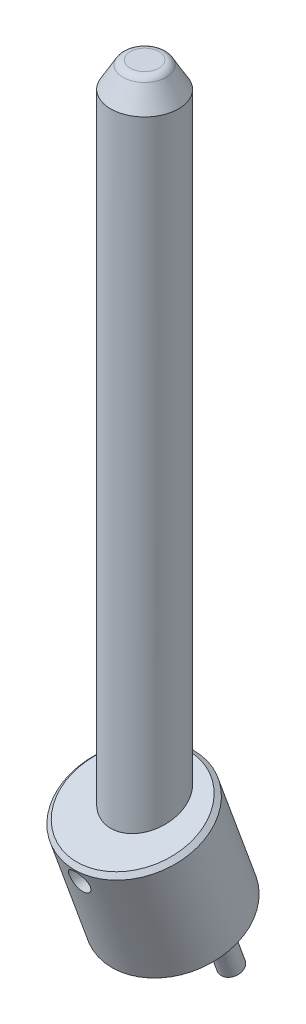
ISO-10303-21;
HEADER;
FILE_DESCRIPTION(('STEP AP214'),'2;1');
FILE_NAME('part.step','',(''),(''),'','','');
FILE_SCHEMA(('AUTOMOTIVE_DESIGN { 1 0 10303 214 1 1 1 1 }'));
ENDSEC;
DATA;
#1=APPLICATION_CONTEXT('core data for automotive mechanical design processes');
#2=APPLICATION_PROTOCOL_DEFINITION('international standard','automotive_design',2000,#1);
#3=PRODUCT_CONTEXT('',#1,'mechanical');
#4=PRODUCT('Part','Part','',(#3));
#5=PRODUCT_RELATED_PRODUCT_CATEGORY('part','',(#4));
#6=PRODUCT_DEFINITION_FORMATION('','',#4);
#7=PRODUCT_DEFINITION_CONTEXT('part definition',#1,'design');
#8=PRODUCT_DEFINITION('design','',#6,#7);
#9=PRODUCT_DEFINITION_SHAPE('','',#8);
#10=(LENGTH_UNIT() NAMED_UNIT(*) SI_UNIT(.MILLI.,.METRE.));
#11=(NAMED_UNIT(*) PLANE_ANGLE_UNIT() SI_UNIT($,.RADIAN.));
#12=(NAMED_UNIT(*) SI_UNIT($,.STERADIAN.) SOLID_ANGLE_UNIT());
#13=UNCERTAINTY_MEASURE_WITH_UNIT(LENGTH_MEASURE(1.E-05),#10,'distance_accuracy_value','');
#14=(GEOMETRIC_REPRESENTATION_CONTEXT(3) GLOBAL_UNCERTAINTY_ASSIGNED_CONTEXT((#13)) GLOBAL_UNIT_ASSIGNED_CONTEXT((#10,
#11,#12)) REPRESENTATION_CONTEXT('',''));
#15=CARTESIAN_POINT('',(0.,0.,0.));
#16=DIRECTION('',(0.,0.,1.));
#17=DIRECTION('',(1.,0.,0.));
#18=AXIS2_PLACEMENT_3D('',#15,#16,#17);
#19=CARTESIAN_POINT('',(0.,174.,0.));
#20=DIRECTION('',(0.,1.,0.));
#21=DIRECTION('',(-1.,0.,0.));
#22=AXIS2_PLACEMENT_3D('',#19,#20,#21);
#23=PLANE('',#22);
#24=CARTESIAN_POINT('',(0.,174.,-3.381197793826));
#25=CARTESIAN_POINT('',(0.0491775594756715,174.,-3.38119852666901));
#26=CARTESIAN_POINT('',(0.0983550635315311,174.,-3.38012493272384));
#27=CARTESIAN_POINT('',(0.196616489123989,174.,-3.37583435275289));
#28=CARTESIAN_POINT('',(0.245700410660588,174.,-3.37261736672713));
#29=CARTESIAN_POINT('',(0.343681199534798,174.,-3.3640452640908));
#30=CARTESIAN_POINT('',(0.392578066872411,174.,-3.35869014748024));
#31=CARTESIAN_POINT('',(0.490091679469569,174.,-3.34585220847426));
#32=CARTESIAN_POINT('',(0.538708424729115,174.,-3.33836938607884));
#33=CARTESIAN_POINT('',(0.635569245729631,174.,-3.32129021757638));
#34=CARTESIAN_POINT('',(0.683813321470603,174.,-3.31169387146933));
#35=CARTESIAN_POINT('',(0.779836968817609,174.,-3.29040593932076));
#36=CARTESIAN_POINT('',(0.827616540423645,174.,-3.27871435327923));
#37=CARTESIAN_POINT('',(0.922620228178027,174.,-3.25325819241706));
#38=CARTESIAN_POINT('',(0.969844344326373,174.,-3.23949361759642));
#39=CARTESIAN_POINT('',(1.06364722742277,174.,-3.20991768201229));
#40=CARTESIAN_POINT('',(1.11022599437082,174.,-3.19410632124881));
#41=CARTESIAN_POINT('',(1.20264951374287,174.,-3.16046691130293));
#42=CARTESIAN_POINT('',(1.24849426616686,174.,-3.14263886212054));
#43=CARTESIAN_POINT('',(1.33936248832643,174.,-3.10500001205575));
#44=CARTESIAN_POINT('',(1.384385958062,174.,-3.08518921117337));
#45=CARTESIAN_POINT('',(1.47352591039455,174.,-3.04362256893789));
#46=CARTESIAN_POINT('',(1.51764239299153,174.,-3.02186672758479));
#47=CARTESIAN_POINT('',(1.60488439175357,174.,-2.9764514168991));
#48=CARTESIAN_POINT('',(1.64800990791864,174.,-2.9527919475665));
#49=CARTESIAN_POINT('',(1.73318788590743,174.,-2.90361442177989));
#50=CARTESIAN_POINT('',(1.77524034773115,174.,-2.87809636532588));
#51=CARTESIAN_POINT('',(1.85819215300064,174.,-2.82525022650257));
#52=CARTESIAN_POINT('',(1.89909149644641,174.,-2.79792214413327));
#53=CARTESIAN_POINT('',(1.97965926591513,174.,-2.74150802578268));
#54=CARTESIAN_POINT('',(2.01932769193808,174.000000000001,-2.7124219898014));
#55=CARTESIAN_POINT('',(2.09735790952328,174.,-2.65254713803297));
#56=CARTESIAN_POINT('',(2.13571970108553,173.999999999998,-2.62175832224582));
#57=CARTESIAN_POINT('',(2.21106439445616,174.000000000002,-2.55853723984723));
#58=CARTESIAN_POINT('',(2.24804729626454,174.000000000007,-2.52610497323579));
#59=CARTESIAN_POINT('',(2.32056094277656,173.999999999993,-2.45965603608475));
#60=CARTESIAN_POINT('',(2.3560916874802,173.999999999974,-2.42563936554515));
#61=CARTESIAN_POINT('',(2.42705213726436,174.000000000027,-2.35468855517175));
#62=CARTESIAN_POINT('',(2.46241950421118,174.000000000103,-2.31769205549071));
#63=CARTESIAN_POINT('',(2.5314601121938,173.999999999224,-2.24214947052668));
#64=CARTESIAN_POINT('',(2.56513331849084,173.999999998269,-2.20360335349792));
#65=CARTESIAN_POINT('',(2.63071590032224,173.99999999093,-2.12503640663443));
#66=CARTESIAN_POINT('',(2.66262520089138,173.999999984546,-2.08501551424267));
#67=CARTESIAN_POINT('',(2.72461562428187,173.999999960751,-2.00357584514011));
#68=CARTESIAN_POINT('',(2.75469662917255,173.999999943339,-1.96215697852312));
#69=CARTESIAN_POINT('',(2.7984051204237,173.999999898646,-1.89905244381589));
#70=CARTESIAN_POINT('',(2.81273996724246,173.999999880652,-1.87785353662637));
#71=CARTESIAN_POINT('',(2.84090934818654,173.999999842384,-1.83514783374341));
#72=CARTESIAN_POINT('',(2.85474423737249,173.999999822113,-1.81364127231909));
#73=CARTESIAN_POINT('',(2.89548728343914,173.999999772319,-1.74864245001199));
#74=CARTESIAN_POINT('',(2.92163476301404,173.999999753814,-1.70466969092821));
#75=CARTESIAN_POINT('',(2.97183520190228,173.999999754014,-1.61554840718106));
#76=CARTESIAN_POINT('',(2.99588817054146,173.99999977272,-1.57039988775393));
#77=CARTESIAN_POINT('',(3.04188859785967,173.999999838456,-1.47904330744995));
#78=CARTESIAN_POINT('',(3.06383619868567,173.999999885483,-1.4328353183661));
#79=CARTESIAN_POINT('',(3.10541271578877,173.999999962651,-1.33939702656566));
#80=CARTESIAN_POINT('',(3.1250419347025,173.999999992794,-1.29216685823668));
#81=CARTESIAN_POINT('',(3.15291976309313,174.000000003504,-1.22146858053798));
#82=CARTESIAN_POINT('',(3.16183489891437,174.000000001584,-1.19825675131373));
#83=CARTESIAN_POINT('',(3.19901992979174,173.999999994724,-1.09818755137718));
#84=CARTESIAN_POINT('',(3.22479363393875,173.99999999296,-1.02037068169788));
#85=CARTESIAN_POINT('',(3.25883872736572,173.999999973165,-0.903503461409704));
#86=CARTESIAN_POINT('',(3.26930037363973,173.999999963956,-0.865070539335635));
#87=CARTESIAN_POINT('',(3.29035807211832,173.999999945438,-0.78187482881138));
#88=CARTESIAN_POINT('',(3.30072437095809,173.999999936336,-0.737052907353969));
#89=CARTESIAN_POINT('',(3.31424558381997,173.999999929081,-0.672514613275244));
#90=CARTESIAN_POINT('',(3.31816009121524,173.999999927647,-0.652953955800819));
#91=CARTESIAN_POINT('',(3.32632060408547,173.999999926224,-0.610180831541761));
#92=CARTESIAN_POINT('',(3.33049625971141,173.999999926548,-0.586954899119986));
#93=CARTESIAN_POINT('',(3.34228609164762,173.999999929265,-0.517153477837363));
#94=CARTESIAN_POINT('',(3.34916374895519,173.999999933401,-0.470451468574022));
#95=CARTESIAN_POINT('',(3.36093725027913,173.999999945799,-0.376800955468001));
#96=CARTESIAN_POINT('',(3.36583314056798,173.999999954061,-0.329852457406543));
#97=CARTESIAN_POINT('',(3.37363894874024,173.999999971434,-0.235792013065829));
#98=CARTESIAN_POINT('',(3.37654894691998,173.999999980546,-0.188680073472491));
#99=CARTESIAN_POINT('',(3.38036477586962,173.999999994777,-0.094378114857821));
#100=CARTESIAN_POINT('',(3.38127072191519,173.999999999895,-0.047188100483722));
#101=CARTESIAN_POINT('',(3.38112480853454,174.000000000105,0.0472251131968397));
#102=CARTESIAN_POINT('',(3.38007141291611,173.999999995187,0.0944483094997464));
#103=CARTESIAN_POINT('',(3.3760506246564,173.999999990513,0.188811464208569));
#104=CARTESIAN_POINT('',(3.3730832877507,173.999999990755,0.235951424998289));
#105=CARTESIAN_POINT('',(3.36523468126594,173.99999999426,0.330073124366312));
#106=CARTESIAN_POINT('',(3.3603533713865,173.999999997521,0.377054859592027));
#107=CARTESIAN_POINT('',(3.34865879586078,174.000000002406,0.470780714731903));
#108=CARTESIAN_POINT('',(3.34184539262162,174.000000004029,0.517524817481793));
#109=CARTESIAN_POINT('',(3.33026552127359,173.999999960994,0.587415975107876));
#110=CARTESIAN_POINT('',(3.32617861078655,173.999999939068,0.610677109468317));
#111=CARTESIAN_POINT('',(3.32001382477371,173.999999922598,0.643328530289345));
#112=CARTESIAN_POINT('',(3.31818160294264,173.999999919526,0.652765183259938));
#113=CARTESIAN_POINT('',(3.30790809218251,173.999999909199,0.704387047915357));
#114=CARTESIAN_POINT('',(3.29862776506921,173.999999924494,0.746407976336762));
#115=CARTESIAN_POINT('',(3.27611885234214,173.999999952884,0.839847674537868));
#116=CARTESIAN_POINT('',(3.26247449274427,173.999999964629,0.891165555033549));
#117=CARTESIAN_POINT('',(3.22698341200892,173.999999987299,1.01297067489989));
#118=CARTESIAN_POINT('',(3.20401223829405,173.999999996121,1.08313569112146));
#119=CARTESIAN_POINT('',(3.16757439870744,174.00000000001,1.18334600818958));
#120=CARTESIAN_POINT('',(3.15590282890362,173.999999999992,1.21405838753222));
#121=CARTESIAN_POINT('',(3.12494638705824,174.000000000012,1.29216796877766));
#122=CARTESIAN_POINT('',(3.10504412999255,174.000000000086,1.33932319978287));
#123=CARTESIAN_POINT('',(3.06313614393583,173.999999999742,1.4326885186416));
#124=CARTESIAN_POINT('',(3.04113038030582,173.999999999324,1.47889859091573));
#125=CARTESIAN_POINT('',(2.99507134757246,173.999999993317,1.5702891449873));
#126=CARTESIAN_POINT('',(2.97101799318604,173.999999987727,1.61546958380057));
#127=CARTESIAN_POINT('',(2.92090425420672,173.99999996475,1.7047092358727));
#128=CARTESIAN_POINT('',(2.8948437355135,173.999999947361,1.74876837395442));
#129=CARTESIAN_POINT('',(2.85429856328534,173.9999999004,1.81395013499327));
#130=CARTESIAN_POINT('',(2.84054017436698,173.999999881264,1.83552759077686));
#131=CARTESIAN_POINT('',(2.81254197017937,173.999999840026,1.87834577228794));
#132=CARTESIAN_POINT('',(2.79830250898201,173.999999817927,1.89958672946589));
#133=CARTESIAN_POINT('',(2.75484041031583,173.999999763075,1.96280026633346));
#134=CARTESIAN_POINT('',(2.72487327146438,173.999999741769,2.00426477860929));
#135=CARTESIAN_POINT('',(2.66302492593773,173.999999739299,2.08573639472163));
#136=CARTESIAN_POINT('',(2.63114372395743,173.999999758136,2.12574350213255));
#137=CARTESIAN_POINT('',(2.56557045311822,173.999999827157,2.2042443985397));
#138=CARTESIAN_POINT('',(2.53187850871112,173.99999987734,2.2427382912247));
#139=CARTESIAN_POINT('',(2.46263073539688,173.999999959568,2.3179988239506));
#140=CARTESIAN_POINT('',(2.42707515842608,173.999999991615,2.35476569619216));
#141=CARTESIAN_POINT('',(2.37140677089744,174.000000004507,2.41027252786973));
#142=CARTESIAN_POINT('',(2.35175738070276,174.000000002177,2.42948514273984));
#143=CARTESIAN_POINT('',(2.26802085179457,173.999999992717,2.50941121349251));
#144=CARTESIAN_POINT('',(2.2017787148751,173.999999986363,2.56792039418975));
#145=CARTESIAN_POINT('',(2.10003782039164,173.999999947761,2.65091291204));
#146=CARTESIAN_POINT('',(2.06619123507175,173.999999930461,2.67746023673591));
#147=CARTESIAN_POINT('',(1.99205588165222,173.999999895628,2.73332764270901));
#148=CARTESIAN_POINT('',(1.95159524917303,173.999999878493,2.76242170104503));
#149=CARTESIAN_POINT('',(1.89261855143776,173.99999986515,2.80284358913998));
#150=CARTESIAN_POINT('',(1.87461412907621,173.999999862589,2.81492542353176));
#151=CARTESIAN_POINT('',(1.83512217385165,173.99999986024,2.84086885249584));
#152=CARTESIAN_POINT('',(1.81358900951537,173.999999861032,2.85466108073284));
#153=CARTESIAN_POINT('',(1.74852510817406,173.999999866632,2.89529179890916));
#154=CARTESIAN_POINT('',(1.70452676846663,173.999999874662,2.92138652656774));
#155=CARTESIAN_POINT('',(1.6153818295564,173.999999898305,2.97152713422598));
#156=CARTESIAN_POINT('',(1.57023526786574,173.999999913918,2.99557308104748));
#157=CARTESIAN_POINT('',(1.47889045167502,173.999999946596,3.04157160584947));
#158=CARTESIAN_POINT('',(1.43269225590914,173.99999996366,3.06352430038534));
#159=CARTESIAN_POINT('',(1.33933610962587,173.99999999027,3.10527343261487));
#160=CARTESIAN_POINT('',(1.29217823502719,173.999999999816,3.12507004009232));
#161=CARTESIAN_POINT('',(1.20065831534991,174.00000000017,3.16109558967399));
#162=CARTESIAN_POINT('',(1.15635789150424,173.999999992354,3.17748154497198));
#163=CARTESIAN_POINT('',(1.06713504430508,173.999999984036,3.20845589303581));
#164=CARTESIAN_POINT('',(1.02221264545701,173.999999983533,3.22304435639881));
#165=CARTESIAN_POINT('',(0.931813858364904,173.999999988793,3.25039463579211));
#166=CARTESIAN_POINT('',(0.886337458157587,173.999999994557,3.26315641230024));
#167=CARTESIAN_POINT('',(0.794895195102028,174.000000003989,3.2868049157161));
#168=CARTESIAN_POINT('',(0.74892929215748,174.000000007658,3.29769148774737));
#169=CARTESIAN_POINT('',(0.686121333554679,173.999999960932,3.31129818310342));
#170=CARTESIAN_POINT('',(0.669443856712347,173.999999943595,3.31479031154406));
#171=CARTESIAN_POINT('',(0.639370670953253,173.999999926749,3.32077891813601));
#172=CARTESIAN_POINT('',(0.625986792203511,173.999999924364,3.32333471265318));
#173=CARTESIAN_POINT('',(0.5647818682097,173.999999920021,3.33461824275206));
#174=CARTESIAN_POINT('',(0.516772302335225,173.999999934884,3.34234416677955));
#175=CARTESIAN_POINT('',(0.428809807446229,173.999999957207,3.3545583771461));
#176=CARTESIAN_POINT('',(0.388901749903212,173.999999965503,3.35937566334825));
#177=CARTESIAN_POINT('',(0.315880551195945,173.99999997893,3.36686744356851));
#178=CARTESIAN_POINT('',(0.282790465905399,173.999999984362,3.36976874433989));
#179=CARTESIAN_POINT('',(0.198641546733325,173.999999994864,3.3759012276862));
#180=CARTESIAN_POINT('',(0.147531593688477,173.999999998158,3.37846406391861));
#181=CARTESIAN_POINT('',(0.0775593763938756,173.999999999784,3.38039422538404));
#182=CARTESIAN_POINT('',(0.0587195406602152,173.999999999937,3.38075747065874));
#183=CARTESIAN_POINT('',(0.0265859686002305,174.000000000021,3.38112029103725));
#184=CARTESIAN_POINT('',(0.0132930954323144,174.000000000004,3.38119546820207));
#185=CARTESIAN_POINT('',(0.,174.,3.381197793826));
#186=B_SPLINE_CURVE_WITH_KNOTS('',3,(#24,#25,#26,#27,#28,#29,#30,#31,#32,#33,#34,#35,#36,#37,
#38,#39,#40,#41,#42,#43,#44,#45,#46,#47,#48,#49,#50,#51,#52,#53,#54,#55,#56,#57,#58,#59,#60,#61,
#62,#63,#64,#65,#66,#67,#68,#69,#70,#71,#72,#73,#74,#75,#76,#77,#78,#79,#80,#81,#82,#83,#84,#85,
#86,#87,#88,#89,#90,#91,#92,#93,#94,#95,#96,#97,#98,#99,#100,#101,#102,#103,#104,#105,#106,#107,
#108,#109,#110,#111,#112,#113,#114,#115,#116,#117,#118,#119,#120,#121,#122,#123,#124,#125,#126,
#127,#128,#129,#130,#131,#132,#133,#134,#135,#136,#137,#138,#139,#140,#141,#142,#143,#144,#145,
#146,#147,#148,#149,#150,#151,#152,#153,#154,#155,#156,#157,#158,#159,#160,#161,#162,#163,#164,
#165,#166,#167,#168,#169,#170,#171,#172,#173,#174,#175,#176,#177,#178,#179,#180,#181,#182,#183,
#184,#185),.UNSPECIFIED.,.F.,.F.,(4,2,2,2,2,2,2,2,2,2,2,2,2,2,2,2,2,2,2,2,2,2,2,2,2,2,2,2,2,2,2,
2,2,2,2,2,2,2,2,2,2,2,2,2,2,2,2,2,2,2,2,2,2,2,2,2,2,2,2,2,2,2,2,2,2,2,2,2,2,2,2,2,2,2,2,2,2,2,2,
2,4),(0.,0.147520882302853,0.295041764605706,0.442562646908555,0.590083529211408,
0.737604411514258,0.885125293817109,1.03264617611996,1.18016705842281,1.32768794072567,
1.47520882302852,1.62272970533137,1.77025058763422,1.91777146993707,2.06529235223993,
2.21281323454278,2.36033411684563,2.50785499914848,2.65537588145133,2.80886971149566,
2.9623666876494,3.11587018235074,3.26938356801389,3.34614986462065,3.42286052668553,
3.5762768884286,3.72969256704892,3.88309788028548,4.03648314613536,4.11107818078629,
4.35672730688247,4.47620511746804,4.61417295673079,4.67401611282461,4.74480627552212,
4.88637772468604,5.02794586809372,5.16950828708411,5.3110625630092,5.4527278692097,
5.59438905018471,5.73605321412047,5.87772746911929,5.94857427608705,5.97741258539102,
6.10647459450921,6.26572562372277,6.48702971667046,6.58558753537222,6.73908100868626,
6.89257701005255,7.04607940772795,7.19959206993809,7.27635828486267,7.35306918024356,
7.50648650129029,7.65990344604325,7.81330985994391,7.96669558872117,8.04913918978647,
8.31394403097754,8.44297054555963,8.59241517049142,8.6574595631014,8.73416806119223,
8.88757342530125,9.0409737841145,9.19436559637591,9.34774532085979,9.48940808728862,
9.63106528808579,9.77272555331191,9.91439751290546,9.96551300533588,10.0063890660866,
10.1522163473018,10.2727850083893,10.3724238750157,10.5258841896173,10.5824125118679,
10.622291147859),.UNSPECIFIED.);
#187=CARTESIAN_POINT('',(0.,174.,-3.3811977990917));
#188=VERTEX_POINT('',#187);
#189=CARTESIAN_POINT('',(0.,174.,3.3811977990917));
#190=VERTEX_POINT('',#189);
#191=EDGE_CURVE('P0_E38',#188,#190,#186,.T.);
#192=ORIENTED_EDGE('',*,*,#191,.F.);
#193=CARTESIAN_POINT('',(0.,174.,0.));
#194=DIRECTION('',(0.,-1.,0.));
#195=DIRECTION('',(0.,0.,1.));
#196=AXIS2_PLACEMENT_3D('',#193,#194,#195);
#197=CIRCLE('',#196,3.381197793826);
#198=EDGE_CURVE('P0_E42',#190,#188,#197,.T.);
#199=ORIENTED_EDGE('',*,*,#198,.F.);
#200=EDGE_LOOP('',(#192,#199));
#201=FACE_BOUND('',#200,.T.);
#202=ADVANCED_FACE('P0_F17',(#201),#23,.T.);
#203=CARTESIAN_POINT('',(0.,172.,0.));
#204=DIRECTION('',(0.,1.,0.));
#205=DIRECTION('',(0.0117940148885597,0.,0.999930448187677));
#206=AXIS2_PLACEMENT_3D('',#203,#204,#205);
#207=TOROIDAL_SURFACE('',#206,3.381197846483,2.);
#208=ORIENTED_EDGE('',*,*,#191,.T.);
#209=ORIENTED_EDGE('',*,*,#198,.T.);
#210=EDGE_LOOP('',(#208,#209));
#211=FACE_BOUND('',#210,.T.);
#212=CARTESIAN_POINT('',(0.,173.000000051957,0.));
#213=DIRECTION('',(0.,-1.,0.));
#214=DIRECTION('',(0.,0.,1.));
#215=AXIS2_PLACEMENT_3D('',#212,#213,#214);
#216=CIRCLE('',#215,5.11324862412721);
#217=CARTESIAN_POINT('',(0.,173.000000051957,5.11324862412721));
#218=VERTEX_POINT('',#217);
#219=EDGE_CURVE('P0_E48',#218,#218,#216,.T.);
#220=ORIENTED_EDGE('',*,*,#219,.F.);
#221=EDGE_LOOP('',(#220));
#222=FACE_BOUND('',#221,.T.);
#223=ADVANCED_FACE('P0_F40',(#211,#222),#207,.T.);
#224=CARTESIAN_POINT('',(0.,0.,0.));
#225=DIRECTION('',(0.,1.,0.));
#226=DIRECTION('',(-1.,0.,0.));
#227=AXIS2_PLACEMENT_3D('',#224,#225,#226);
#228=PLANE('',#227);
#229=CARTESIAN_POINT('',(0.,5.90868528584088E-07,0.));
#230=DIRECTION('',(0.,1.,0.));
#231=DIRECTION('',(-1.,0.,0.));
#232=AXIS2_PLACEMENT_3D('',#229,#230,#231);
#233=CIRCLE('',#232,6.99999890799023);
#234=CARTESIAN_POINT('',(-6.99999890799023,5.90868528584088E-07,0.));
#235=VERTEX_POINT('',#234);
#236=EDGE_CURVE('P0_E85',#235,#235,#233,.T.);
#237=ORIENTED_EDGE('',*,*,#236,.F.);
#238=EDGE_LOOP('',(#237));
#239=FACE_BOUND('',#238,.T.);
#240=ADVANCED_FACE('P0_F76',(#239),#228,.F.);
#241=CARTESIAN_POINT('',(0.,14.,2.94337567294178));
#242=DIRECTION('',(0.,0.,1.));
#243=DIRECTION('',(0.,-1.,0.));
#244=AXIS2_PLACEMENT_3D('',#241,#242,#243);
#245=CONICAL_SURFACE('',#244,2.50000000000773,1.04719755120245);
#246=CARTESIAN_POINT('',(0.,14.0000000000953,1.49999999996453));
#247=VERTEX_POINT('',#246);
#248=VERTEX_LOOP('',#247);
#249=FACE_BOUND('',#248,.T.);
#250=CARTESIAN_POINT('',(0.,14.,2.943375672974));
#251=DIRECTION('',(0.,0.,1.));
#252=DIRECTION('',(0.,-1.,0.));
#253=AXIS2_PLACEMENT_3D('',#250,#251,#252);
#254=CIRCLE('',#253,2.5);
#255=CARTESIAN_POINT('',(0.,11.5,2.943375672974));
#256=VERTEX_POINT('',#255);
#257=EDGE_CURVE('P0_E82',#256,#256,#254,.T.);
#258=ORIENTED_EDGE('',*,*,#257,.T.);
#259=EDGE_LOOP('',(#258));
#260=FACE_BOUND('',#259,.T.);
#261=ADVANCED_FACE('P0_F116',(#249,#260),#245,.F.);
#262=CARTESIAN_POINT('',(0.,168.000000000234,0.));
#263=DIRECTION('',(0.,-1.,0.));
#264=DIRECTION('',(1.,0.,0.));
#265=AXIS2_PLACEMENT_3D('',#262,#263,#264);
#266=CONICAL_SURFACE('',#265,7.99999999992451,0.52359877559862);
#267=CARTESIAN_POINT('',(0.,168.,0.));
#268=DIRECTION('',(0.,1.,0.));
#269=DIRECTION('',(-1.,0.,0.));
#270=AXIS2_PLACEMENT_3D('',#267,#268,#269);
#271=CIRCLE('',#270,8.);
#272=CARTESIAN_POINT('',(-8.,168.,0.));
#273=VERTEX_POINT('',#272);
#274=EDGE_CURVE('P0_E92',#273,#273,#271,.F.);
#275=ORIENTED_EDGE('',*,*,#274,.F.);
#276=EDGE_LOOP('',(#275));
#277=FACE_BOUND('',#276,.T.);
#278=ORIENTED_EDGE('',*,*,#219,.T.);
#279=EDGE_LOOP('',(#278));
#280=FACE_BOUND('',#279,.T.);
#281=ADVANCED_FACE('P0_F108',(#277,#280),#266,.T.);
#282=CARTESIAN_POINT('',(0.,1.00000124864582,0.));
#283=DIRECTION('',(0.,1.,0.));
#284=DIRECTION('',(-1.,0.,0.));
#285=AXIS2_PLACEMENT_3D('',#282,#283,#284);
#286=CONICAL_SURFACE('',#285,7.99999932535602,0.785398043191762);
#287=CARTESIAN_POINT('',(0.,1.000000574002,0.));
#288=DIRECTION('',(0.,1.,0.));
#289=DIRECTION('',(-1.,0.,0.));
#290=AXIS2_PLACEMENT_3D('',#287,#288,#289);
#291=CIRCLE('',#290,8.);
#292=CARTESIAN_POINT('',(-8.,1.000000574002,0.));
#293=VERTEX_POINT('',#292);
#294=EDGE_CURVE('P0_E28',#293,#293,#291,.T.);
#295=ORIENTED_EDGE('',*,*,#294,.F.);
#296=EDGE_LOOP('',(#295));
#297=FACE_BOUND('',#296,.T.);
#298=ORIENTED_EDGE('',*,*,#236,.T.);
#299=EDGE_LOOP('',(#298));
#300=FACE_BOUND('',#299,.T.);
#301=ADVANCED_FACE('P0_F105',(#297,#300),#286,.T.);
#302=CARTESIAN_POINT('',(0.,14.,1.075));
#303=DIRECTION('',(0.,0.,1.));
#304=DIRECTION('',(0.,-1.,0.));
#305=AXIS2_PLACEMENT_3D('',#302,#303,#304);
#306=CYLINDRICAL_SURFACE('',#305,2.5);
#307=ORIENTED_EDGE('',*,*,#257,.F.);
#308=EDGE_LOOP('',(#307));
#309=FACE_BOUND('',#308,.T.);
#310=CARTESIAN_POINT('',(0.,11.5,8.));
#311=CARTESIAN_POINT('',(-0.136696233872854,11.5000075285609,7.99999486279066));
#312=CARTESIAN_POINT('',(-0.273538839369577,11.5112631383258,7.99645812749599));
#313=CARTESIAN_POINT('',(-0.543359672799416,11.5559205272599,7.98267442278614));
#314=CARTESIAN_POINT('',(-0.676330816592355,11.589360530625,7.97241587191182));
#315=CARTESIAN_POINT('',(-0.934271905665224,11.6771461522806,7.94631394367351));
#316=CARTESIAN_POINT('',(-1.05925832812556,11.7314469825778,7.93048253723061));
#317=CARTESIAN_POINT('',(-1.2983071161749,11.8592577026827,7.89487323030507));
#318=CARTESIAN_POINT('',(-1.4123711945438,11.9327645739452,7.87509595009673));
#319=CARTESIAN_POINT('',(-1.62992724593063,12.0993097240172,7.83300483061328));
#320=CARTESIAN_POINT('',(-1.73303436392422,12.1928367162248,7.81063552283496));
#321=CARTESIAN_POINT('',(-1.92239021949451,12.3957308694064,7.76620212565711));
#322=CARTESIAN_POINT('',(-2.00863490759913,12.5051018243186,7.74413811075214));
#323=CARTESIAN_POINT('',(-2.16388692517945,12.7398894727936,7.70222283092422));
#324=CARTESIAN_POINT('',(-2.23241606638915,12.8656356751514,7.6824396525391));
#325=CARTESIAN_POINT('',(-2.34719509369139,13.1275854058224,7.64815595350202));
#326=CARTESIAN_POINT('',(-2.3934509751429,13.2637861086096,7.6336540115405));
#327=CARTESIAN_POINT('',(-2.4609691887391,13.5384561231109,7.61215214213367));
#328=CARTESIAN_POINT('',(-2.48294218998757,13.6767336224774,7.60493946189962));
#329=CARTESIAN_POINT('',(-2.50349110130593,13.9551861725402,7.59820110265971));
#330=CARTESIAN_POINT('',(-2.50207322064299,14.0953607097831,7.59867338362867));
#331=CARTESIAN_POINT('',(-2.47643652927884,14.3677485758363,7.60706377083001));
#332=CARTESIAN_POINT('',(-2.45312128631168,14.5000575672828,7.61468679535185));
#333=CARTESIAN_POINT('',(-2.38581648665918,14.7587836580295,7.63604044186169));
#334=CARTESIAN_POINT('',(-2.34182462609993,14.8852000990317,7.64977174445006));
#335=CARTESIAN_POINT('',(-2.23377596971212,15.1307074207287,7.68202134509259));
#336=CARTESIAN_POINT('',(-2.16943495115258,15.2496640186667,7.7006067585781));
#337=CARTESIAN_POINT('',(-2.02271557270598,15.4753816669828,7.74043834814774));
#338=CARTESIAN_POINT('',(-1.94033355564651,15.5821402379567,7.76168506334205));
#339=CARTESIAN_POINT('',(-1.75545127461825,15.7855312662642,7.80562654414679));
#340=CARTESIAN_POINT('',(-1.65220788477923,15.8814846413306,7.82834327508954));
#341=CARTESIAN_POINT('',(-1.43076939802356,16.0549161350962,7.87182395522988));
#342=CARTESIAN_POINT('',(-1.31256787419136,16.1323862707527,7.8925870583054));
#343=CARTESIAN_POINT('',(-1.06322528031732,16.2671146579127,7.93004255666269));
#344=CARTESIAN_POINT('',(-0.931982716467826,16.3241954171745,7.94669883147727));
#345=CARTESIAN_POINT('',(-0.661263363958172,16.4151681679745,7.97377752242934));
#346=CARTESIAN_POINT('',(-0.521804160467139,16.4491078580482,7.98421275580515));
#347=CARTESIAN_POINT('',(-0.317572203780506,16.4805676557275,7.9939447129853));
#348=CARTESIAN_POINT('',(-0.25430866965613,16.4878463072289,7.99620897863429));
#349=CARTESIAN_POINT('',(-0.127374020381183,16.4975642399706,7.99923782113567));
#350=CARTESIAN_POINT('',(-0.0637029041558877,16.5000035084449,8.000002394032));
#351=CARTESIAN_POINT('',(0.13669623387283,16.4999924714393,7.99999486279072));
#352=CARTESIAN_POINT('',(0.273538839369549,16.4887368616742,7.996458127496));
#353=CARTESIAN_POINT('',(0.543359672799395,16.4440794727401,7.98267442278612));
#354=CARTESIAN_POINT('',(0.676330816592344,16.410639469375,7.97241587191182));
#355=CARTESIAN_POINT('',(0.934271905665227,16.3228538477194,7.94631394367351));
#356=CARTESIAN_POINT('',(1.05925832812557,16.2685530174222,7.93048253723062));
#357=CARTESIAN_POINT('',(1.2983071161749,16.1407422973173,7.89487323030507));
#358=CARTESIAN_POINT('',(1.4123711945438,16.0672354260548,7.87509595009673));
#359=CARTESIAN_POINT('',(1.62992724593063,15.9006902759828,7.83300483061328));
#360=CARTESIAN_POINT('',(1.73303436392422,15.8071632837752,7.81063552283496));
#361=CARTESIAN_POINT('',(1.92239021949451,15.6042691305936,7.76620212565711));
#362=CARTESIAN_POINT('',(2.00863490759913,15.4948981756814,7.74413811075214));
#363=CARTESIAN_POINT('',(2.16388692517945,15.2601105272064,7.70222283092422));
#364=CARTESIAN_POINT('',(2.23241606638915,15.1343643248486,7.6824396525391));
#365=CARTESIAN_POINT('',(2.34719509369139,14.8724145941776,7.64815595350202));
#366=CARTESIAN_POINT('',(2.3934509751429,14.7362138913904,7.6336540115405));
#367=CARTESIAN_POINT('',(2.4609691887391,14.4615438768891,7.61215214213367));
#368=CARTESIAN_POINT('',(2.48294218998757,14.3232663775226,7.60493946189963));
#369=CARTESIAN_POINT('',(2.50349110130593,14.0448138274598,7.59820110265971));
#370=CARTESIAN_POINT('',(2.50207322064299,13.9046392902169,7.59867338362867));
#371=CARTESIAN_POINT('',(2.47643652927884,13.6322514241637,7.60706377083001));
#372=CARTESIAN_POINT('',(2.45312128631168,13.4999424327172,7.61468679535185));
#373=CARTESIAN_POINT('',(2.38581648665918,13.2412163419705,7.63604044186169));
#374=CARTESIAN_POINT('',(2.34182462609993,13.1147999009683,7.64977174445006));
#375=CARTESIAN_POINT('',(2.23377596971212,12.8692925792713,7.68202134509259));
#376=CARTESIAN_POINT('',(2.16943495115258,12.7503359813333,7.7006067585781));
#377=CARTESIAN_POINT('',(2.02271557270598,12.5246183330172,7.74043834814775));
#378=CARTESIAN_POINT('',(1.94033355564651,12.4178597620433,7.76168506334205));
#379=CARTESIAN_POINT('',(1.75545127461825,12.2144687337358,7.80562654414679));
#380=CARTESIAN_POINT('',(1.65220788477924,12.1185153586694,7.82834327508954));
#381=CARTESIAN_POINT('',(1.43076939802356,11.9450838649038,7.87182395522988));
#382=CARTESIAN_POINT('',(1.31256787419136,11.8676137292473,7.8925870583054));
#383=CARTESIAN_POINT('',(1.06322528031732,11.7328853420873,7.93004255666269));
#384=CARTESIAN_POINT('',(0.931982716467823,11.6758045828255,7.94669883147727));
#385=CARTESIAN_POINT('',(0.661263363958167,11.5848318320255,7.97377752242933));
#386=CARTESIAN_POINT('',(0.521804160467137,11.5508921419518,7.98421275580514));
#387=CARTESIAN_POINT('',(0.317572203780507,11.5194323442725,7.9939447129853));
#388=CARTESIAN_POINT('',(0.254308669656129,11.512153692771,7.9962089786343));
#389=CARTESIAN_POINT('',(0.127374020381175,11.5024357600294,7.99923782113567));
#390=CARTESIAN_POINT('',(0.0637029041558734,11.4999964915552,8.00000239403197));
#391=CARTESIAN_POINT('',(0.,11.5,8.));
#392=B_SPLINE_CURVE_WITH_KNOTS('',3,(#310,#311,#312,#313,#314,#315,#316,#317,#318,#319,#320,
#321,#322,#323,#324,#325,#326,#327,#328,#329,#330,#331,#332,#333,#334,#335,#336,#337,#338,#339,
#340,#341,#342,#343,#344,#345,#346,#347,#348,#349,#350,#351,#352,#353,#354,#355,#356,#357,#358,
#359,#360,#361,#362,#363,#364,#365,#366,#367,#368,#369,#370,#371,#372,#373,#374,#375,#376,#377,
#378,#379,#380,#381,#382,#383,#384,#385,#386,#387,#388,#389,#390,#391),.UNSPECIFIED.,.T.,.F.,(4,
2,2,2,2,2,2,2,2,2,2,2,2,2,2,2,2,2,2,2,2,2,2,2,2,2,2,2,2,2,2,2,2,2,2,2,2,2,2,2,4),(0.,
0.409843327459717,0.820394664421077,1.23006943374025,1.6396798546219,2.06074511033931,
2.48191136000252,2.91347666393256,3.34492573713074,3.76338291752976,4.18172901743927,
4.58353732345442,4.98539041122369,5.39312450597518,5.80094133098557,6.22725884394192,
6.65376015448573,7.08388858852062,7.51312773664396,7.70412159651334,7.89511596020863,
8.30495928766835,8.71551062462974,9.12518539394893,9.53479581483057,9.95586107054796,
10.3770273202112,10.8085926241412,11.2400416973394,11.6584988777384,12.0768449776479,
12.4786532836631,12.8805063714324,13.2882404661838,13.6960572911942,14.1223748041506,
14.5488761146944,14.9790045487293,15.4082436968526,15.599237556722,15.7902319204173),.UNSPECIFIED.);
#393=CARTESIAN_POINT('',(0.,11.5,8.));
#394=VERTEX_POINT('',#393);
#395=EDGE_CURVE('P0_E11',#394,#394,#392,.T.);
#396=ORIENTED_EDGE('',*,*,#395,.F.);
#397=EDGE_LOOP('',(#396));
#398=FACE_BOUND('',#397,.T.);
#399=ADVANCED_FACE('P0_F107',(#309,#398),#306,.F.);
#400=CARTESIAN_POINT('',(0.,-8.7,0.));
#401=DIRECTION('',(0.,1.,0.));
#402=DIRECTION('',(-1.,0.,0.));
#403=AXIS2_PLACEMENT_3D('',#400,#401,#402);
#404=CYLINDRICAL_SURFACE('',#403,8.);
#405=ORIENTED_EDGE('',*,*,#274,.T.);
#406=EDGE_LOOP('',(#405));
#407=FACE_BOUND('',#406,.T.);
#408=ORIENTED_EDGE('',*,*,#294,.T.);
#409=EDGE_LOOP('',(#408));
#410=FACE_BOUND('',#409,.T.);
#411=ORIENTED_EDGE('',*,*,#395,.T.);
#412=EDGE_LOOP('',(#411));
#413=FACE_BOUND('',#412,.T.);
#414=ADVANCED_FACE('P0_F102',(#407,#410,#413),#404,.T.);
#415=CLOSED_SHELL('',(#202,#223,#240,#261,#281,#301,#399,#414));
#416=MANIFOLD_SOLID_BREP('P0_B1',#415);
#417=CARTESIAN_POINT('',(0.,-10.3851484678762,-9.32263722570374));
#418=DIRECTION('',(0.,-0.939692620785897,-0.342020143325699));
#419=DIRECTION('',(0.,0.342020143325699,-0.939692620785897));
#420=AXIS2_PLACEMENT_3D('',#417,#418,#419);
#421=PLANE('',#420);
#422=CARTESIAN_POINT('',(-11.25,-10.3851484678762,-9.32263722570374));
#423=DIRECTION('',(0.,-0.939692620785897,-0.342020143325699));
#424=DIRECTION('',(0.,0.342020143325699,-0.939692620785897));
#425=AXIS2_PLACEMENT_3D('',#422,#423,#424);
#426=CIRCLE('',#425,1.9999654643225);
#427=CARTESIAN_POINT('',(-11.25,-9.7011199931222,-11.2019900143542));
#428=VERTEX_POINT('',#427);
#429=EDGE_CURVE('P1_E17',#428,#428,#426,.F.);
#430=ORIENTED_EDGE('',*,*,#429,.F.);
#431=EDGE_LOOP('',(#430));
#432=FACE_BOUND('',#431,.T.);
#433=ADVANCED_FACE('P1_F14',(#432),#421,.T.);
#434=CARTESIAN_POINT('',(0.,-10.3851484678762,-9.32263722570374));
#435=DIRECTION('',(0.,-0.939692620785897,-0.342020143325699));
#436=DIRECTION('',(0.,0.342020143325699,-0.939692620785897));
#437=AXIS2_PLACEMENT_3D('',#434,#435,#436);
#438=PLANE('',#437);
#439=CARTESIAN_POINT('',(11.25,-10.3851484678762,-9.32263722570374));
#440=DIRECTION('',(0.,-0.939692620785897,-0.342020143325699));
#441=DIRECTION('',(0.,0.342020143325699,-0.939692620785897));
#442=AXIS2_PLACEMENT_3D('',#439,#440,#441);
#443=CIRCLE('',#442,1.99996546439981);
#444=CARTESIAN_POINT('',(11.25,-9.70111999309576,-11.2019900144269));
#445=VERTEX_POINT('',#444);
#446=EDGE_CURVE('P1_E114',#445,#445,#443,.F.);
#447=ORIENTED_EDGE('',*,*,#446,.F.);
#448=EDGE_LOOP('',(#447));
#449=FACE_BOUND('',#448,.T.);
#450=ADVANCED_FACE('P1_F104',(#449),#438,.T.);
#451=CARTESIAN_POINT('',(0.,0.,0.));
#452=DIRECTION('',(0.,-1.,0.));
#453=DIRECTION('',(0.,0.,-1.));
#454=AXIS2_PLACEMENT_3D('',#451,#452,#453);
#455=PLANE('',#454);
#456=CARTESIAN_POINT('',(0.,5.27789617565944E-13,2.55611504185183E-12));
#457=DIRECTION('',(0.,-1.,0.));
#458=DIRECTION('',(0.,0.,-1.));
#459=AXIS2_PLACEMENT_3D('',#456,#457,#458);
#460=CIRCLE('',#459,8.);
#461=CARTESIAN_POINT('',(0.,5.27789617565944E-13,-7.99999999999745));
#462=VERTEX_POINT('',#461);
#463=EDGE_CURVE('P1_E116',#462,#462,#460,.F.);
#464=ORIENTED_EDGE('',*,*,#463,.T.);
#465=EDGE_LOOP('',(#464));
#466=FACE_BOUND('',#465,.T.);
#467=ADVANCED_FACE('P1_F101',(#466),#455,.F.);
#468=CARTESIAN_POINT('',(-11.25,-9.9152792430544,-9.15161881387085));
#469=DIRECTION('',(0.,0.939692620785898,0.342020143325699));
#470=DIRECTION('',(0.,-0.342020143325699,0.939692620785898));
#471=AXIS2_PLACEMENT_3D('',#468,#469,#470);
#472=CONICAL_SURFACE('',#471,2.49998121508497,0.78538952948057);
#473=CARTESIAN_POINT('',(-11.25,-9.91526159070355,-9.15161238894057));
#474=DIRECTION('',(0.,0.939692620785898,0.342020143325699));
#475=DIRECTION('',(0.,-0.342020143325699,0.939692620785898));
#476=AXIS2_PLACEMENT_3D('',#473,#474,#475);
#477=CIRCLE('',#476,2.5);
#478=CARTESIAN_POINT('',(-11.25,-10.7703119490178,-6.80238083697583));
#479=VERTEX_POINT('',#478);
#480=EDGE_CURVE('P1_E118',#479,#479,#477,.T.);
#481=ORIENTED_EDGE('',*,*,#480,.F.);
#482=EDGE_LOOP('',(#481));
#483=FACE_BOUND('',#482,.T.);
#484=ORIENTED_EDGE('',*,*,#429,.T.);
#485=EDGE_LOOP('',(#484));
#486=FACE_BOUND('',#485,.T.);
#487=ADVANCED_FACE('P1_F97',(#483,#486),#472,.T.);
#488=CARTESIAN_POINT('',(11.25,-9.9152792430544,-9.15161881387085));
#489=DIRECTION('',(0.,0.939692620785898,0.342020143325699));
#490=DIRECTION('',(0.,-0.342020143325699,0.939692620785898));
#491=AXIS2_PLACEMENT_3D('',#488,#489,#490);
#492=CONICAL_SURFACE('',#491,2.49998121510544,0.785389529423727);
#493=CARTESIAN_POINT('',(11.25,-9.91526159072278,-9.15161238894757));
#494=DIRECTION('',(0.,0.939692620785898,0.342020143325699));
#495=DIRECTION('',(0.,-0.342020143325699,0.939692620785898));
#496=AXIS2_PLACEMENT_3D('',#493,#494,#495);
#497=CIRCLE('',#496,2.5);
#498=CARTESIAN_POINT('',(11.25,-10.770311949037,-6.80238083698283));
#499=VERTEX_POINT('',#498);
#500=EDGE_CURVE('P1_E123',#499,#499,#497,.T.);
#501=ORIENTED_EDGE('',*,*,#500,.F.);
#502=EDGE_LOOP('',(#501));
#503=FACE_BOUND('',#502,.T.);
#504=ORIENTED_EDGE('',*,*,#446,.T.);
#505=EDGE_LOOP('',(#504));
#506=FACE_BOUND('',#505,.T.);
#507=ADVANCED_FACE('P1_F92',(#503,#506),#492,.T.);
#508=CARTESIAN_POINT('',(0.,38.5282654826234,2.55524768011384E-12));
#509=DIRECTION('',(0.,-1.,0.));
#510=DIRECTION('',(0.,0.,-1.));
#511=AXIS2_PLACEMENT_3D('',#508,#509,#510);
#512=CYLINDRICAL_SURFACE('',#511,8.);
#513=CARTESIAN_POINT('',(0.,23.9999999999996,2.55438031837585E-12));
#514=DIRECTION('',(0.,0.939692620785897,0.342020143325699));
#515=DIRECTION('',(0.,-0.342020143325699,0.939692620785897));
#516=AXIS2_PLACEMENT_3D('',#513,#514,#515);
#517=ELLIPSE('',#516,8.5134221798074,8.);
#518=CARTESIAN_POINT('',(0.,21.0882381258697,8.00000000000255));
#519=VERTEX_POINT('',#518);
#520=EDGE_CURVE('P1_E79',#519,#519,#517,.F.);
#521=ORIENTED_EDGE('',*,*,#520,.F.);
#522=EDGE_LOOP('',(#521));
#523=FACE_BOUND('',#522,.T.);
#524=ORIENTED_EDGE('',*,*,#463,.F.);
#525=EDGE_LOOP('',(#524));
#526=FACE_BOUND('',#525,.T.);
#527=CARTESIAN_POINT('',(0.,16.4999999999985,8.00000000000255));
#528=CARTESIAN_POINT('',(-0.136696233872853,16.4999924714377,7.99999486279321));
#529=CARTESIAN_POINT('',(-0.273538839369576,16.4887368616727,7.99645812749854));
#530=CARTESIAN_POINT('',(-0.543359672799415,16.4440794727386,7.98267442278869));
#531=CARTESIAN_POINT('',(-0.676330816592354,16.4106394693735,7.97241587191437));
#532=CARTESIAN_POINT('',(-0.934271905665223,16.3228538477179,7.94631394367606));
#533=CARTESIAN_POINT('',(-1.05925832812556,16.2685530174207,7.93048253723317));
#534=CARTESIAN_POINT('',(-1.2983071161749,16.1407422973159,7.89487323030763));
#535=CARTESIAN_POINT('',(-1.4123711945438,16.0672354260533,7.87509595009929));
#536=CARTESIAN_POINT('',(-1.62992724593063,15.9006902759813,7.83300483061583));
#537=CARTESIAN_POINT('',(-1.73303436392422,15.8071632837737,7.81063552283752));
#538=CARTESIAN_POINT('',(-1.92239021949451,15.6042691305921,7.76620212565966));
#539=CARTESIAN_POINT('',(-2.00863490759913,15.4948981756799,7.7441381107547));
#540=CARTESIAN_POINT('',(-2.16388692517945,15.2601105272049,7.70222283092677));
#541=CARTESIAN_POINT('',(-2.23241606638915,15.1343643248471,7.68243965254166));
#542=CARTESIAN_POINT('',(-2.34719509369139,14.8724145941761,7.64815595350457));
#543=CARTESIAN_POINT('',(-2.3934509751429,14.736213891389,7.63365401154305));
#544=CARTESIAN_POINT('',(-2.4609691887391,14.4615438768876,7.61215214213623));
#545=CARTESIAN_POINT('',(-2.48294218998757,14.3232663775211,7.60493946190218));
#546=CARTESIAN_POINT('',(-2.50349110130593,14.0448138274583,7.59820110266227));
#547=CARTESIAN_POINT('',(-2.50207322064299,13.9046392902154,7.59867338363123));
#548=CARTESIAN_POINT('',(-2.47643652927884,13.6322514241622,7.60706377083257));
#549=CARTESIAN_POINT('',(-2.45312128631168,13.4999424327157,7.61468679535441));
#550=CARTESIAN_POINT('',(-2.38581648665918,13.241216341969,7.63604044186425));
#551=CARTESIAN_POINT('',(-2.34182462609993,13.1147999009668,7.64977174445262));
#552=CARTESIAN_POINT('',(-2.23377596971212,12.8692925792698,7.68202134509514));
#553=CARTESIAN_POINT('',(-2.16943495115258,12.7503359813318,7.70060675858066));
#554=CARTESIAN_POINT('',(-2.02271557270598,12.5246183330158,7.7404383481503));
#555=CARTESIAN_POINT('',(-1.94033355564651,12.4178597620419,7.7616850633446));
#556=CARTESIAN_POINT('',(-1.75545127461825,12.2144687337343,7.80562654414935));
#557=CARTESIAN_POINT('',(-1.65220788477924,12.1185153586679,7.8283432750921));
#558=CARTESIAN_POINT('',(-1.43076939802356,11.9450838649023,7.87182395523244));
#559=CARTESIAN_POINT('',(-1.31256787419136,11.8676137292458,7.89258705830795));
#560=CARTESIAN_POINT('',(-1.06322528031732,11.7328853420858,7.93004255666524));
#561=CARTESIAN_POINT('',(-0.931982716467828,11.675804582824,7.94669883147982));
#562=CARTESIAN_POINT('',(-0.661263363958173,11.584831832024,7.97377752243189));
#563=CARTESIAN_POINT('',(-0.52180416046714,11.5508921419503,7.98421275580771));
#564=CARTESIAN_POINT('',(-0.317572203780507,11.5194323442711,7.99394471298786));
#565=CARTESIAN_POINT('',(-0.254308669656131,11.5121536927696,7.99620897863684));
#566=CARTESIAN_POINT('',(-0.127374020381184,11.5024357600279,7.99923782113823));
#567=CARTESIAN_POINT('',(-0.0637029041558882,11.4999964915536,8.00000239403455));
#568=CARTESIAN_POINT('',(0.13669623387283,11.5000075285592,7.99999486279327));
#569=CARTESIAN_POINT('',(0.273538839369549,11.5112631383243,7.99645812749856));
#570=CARTESIAN_POINT('',(0.543359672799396,11.5559205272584,7.98267442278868));
#571=CARTESIAN_POINT('',(0.676330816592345,11.5893605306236,7.97241587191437));
#572=CARTESIAN_POINT('',(0.934271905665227,11.6771461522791,7.94631394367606));
#573=CARTESIAN_POINT('',(1.05925832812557,11.7314469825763,7.93048253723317));
#574=CARTESIAN_POINT('',(1.2983071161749,11.8592577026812,7.89487323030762));
#575=CARTESIAN_POINT('',(1.4123711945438,11.9327645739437,7.87509595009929));
#576=CARTESIAN_POINT('',(1.62992724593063,12.0993097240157,7.83300483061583));
#577=CARTESIAN_POINT('',(1.73303436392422,12.1928367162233,7.81063552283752));
#578=CARTESIAN_POINT('',(1.92239021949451,12.3957308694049,7.76620212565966));
#579=CARTESIAN_POINT('',(2.00863490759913,12.5051018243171,7.7441381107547));
#580=CARTESIAN_POINT('',(2.16388692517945,12.7398894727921,7.70222283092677));
#581=CARTESIAN_POINT('',(2.23241606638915,12.86563567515,7.68243965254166));
#582=CARTESIAN_POINT('',(2.34719509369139,13.1275854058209,7.64815595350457));
#583=CARTESIAN_POINT('',(2.3934509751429,13.2637861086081,7.63365401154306));
#584=CARTESIAN_POINT('',(2.4609691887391,13.5384561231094,7.61215214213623));
#585=CARTESIAN_POINT('',(2.48294218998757,13.676733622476,7.60493946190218));
#586=CARTESIAN_POINT('',(2.50349110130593,13.9551861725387,7.59820110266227));
#587=CARTESIAN_POINT('',(2.50207322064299,14.0953607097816,7.59867338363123));
#588=CARTESIAN_POINT('',(2.47643652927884,14.3677485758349,7.60706377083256));
#589=CARTESIAN_POINT('',(2.45312128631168,14.5000575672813,7.61468679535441));
#590=CARTESIAN_POINT('',(2.38581648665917,14.758783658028,7.63604044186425));
#591=CARTESIAN_POINT('',(2.34182462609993,14.8852000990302,7.64977174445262));
#592=CARTESIAN_POINT('',(2.23377596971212,15.1307074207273,7.68202134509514));
#593=CARTESIAN_POINT('',(2.16943495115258,15.2496640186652,7.70060675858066));
#594=CARTESIAN_POINT('',(2.02271557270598,15.4753816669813,7.7404383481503));
#595=CARTESIAN_POINT('',(1.94033355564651,15.5821402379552,7.7616850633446));
#596=CARTESIAN_POINT('',(1.75545127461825,15.7855312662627,7.80562654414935));
#597=CARTESIAN_POINT('',(1.65220788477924,15.8814846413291,7.8283432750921));
#598=CARTESIAN_POINT('',(1.43076939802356,16.0549161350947,7.87182395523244));
#599=CARTESIAN_POINT('',(1.31256787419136,16.1323862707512,7.89258705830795));
#600=CARTESIAN_POINT('',(1.06322528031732,16.2671146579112,7.93004255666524));
#601=CARTESIAN_POINT('',(0.931982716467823,16.324195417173,7.94669883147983));
#602=CARTESIAN_POINT('',(0.661263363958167,16.415168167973,7.97377752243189));
#603=CARTESIAN_POINT('',(0.521804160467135,16.4491078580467,7.9842127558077));
#604=CARTESIAN_POINT('',(0.317572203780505,16.480567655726,7.99394471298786));
#605=CARTESIAN_POINT('',(0.254308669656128,16.4878463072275,7.99620897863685));
#606=CARTESIAN_POINT('',(0.127374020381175,16.4975642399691,7.99923782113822));
#607=CARTESIAN_POINT('',(0.0637029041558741,16.5000035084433,8.00000239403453));
#608=CARTESIAN_POINT('',(0.,16.4999999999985,8.00000000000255));
#609=B_SPLINE_CURVE_WITH_KNOTS('',3,(#527,#528,#529,#530,#531,#532,#533,#534,#535,#536,#537,
#538,#539,#540,#541,#542,#543,#544,#545,#546,#547,#548,#549,#550,#551,#552,#553,#554,#555,#556,
#557,#558,#559,#560,#561,#562,#563,#564,#565,#566,#567,#568,#569,#570,#571,#572,#573,#574,#575,
#576,#577,#578,#579,#580,#581,#582,#583,#584,#585,#586,#587,#588,#589,#590,#591,#592,#593,#594,
#595,#596,#597,#598,#599,#600,#601,#602,#603,#604,#605,#606,#607,#608),.UNSPECIFIED.,.T.,.F.,(4,
2,2,2,2,2,2,2,2,2,2,2,2,2,2,2,2,2,2,2,2,2,2,2,2,2,2,2,2,2,2,2,2,2,2,2,2,2,2,2,4),(0.,
0.409843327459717,0.820394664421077,1.23006943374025,1.6396798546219,2.06074511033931,
2.48191136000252,2.91347666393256,3.34492573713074,3.76338291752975,4.18172901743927,
4.58353732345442,4.9853904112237,5.39312450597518,5.80094133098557,6.22725884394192,
6.65376015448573,7.08388858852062,7.51312773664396,7.70412159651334,7.89511596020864,
8.30495928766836,8.71551062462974,9.12518539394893,9.53479581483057,9.95586107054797,
10.3770273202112,10.8085926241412,11.2400416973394,11.6584988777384,12.0768449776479,
12.4786532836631,12.8805063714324,13.2882404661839,13.6960572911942,14.1223748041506,
14.5488761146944,14.9790045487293,15.4082436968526,15.599237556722,15.7902319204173),.UNSPECIFIED.);
#610=CARTESIAN_POINT('',(0.,16.4999999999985,8.00000000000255));
#611=VERTEX_POINT('',#610);
#612=EDGE_CURVE('P1_E76',#611,#611,#609,.T.);
#613=ORIENTED_EDGE('',*,*,#612,.T.);
#614=EDGE_LOOP('',(#613));
#615=FACE_BOUND('',#614,.T.);
#616=ADVANCED_FACE('P1_F86',(#523,#526,#615),#512,.F.);
#617=CARTESIAN_POINT('',(-11.25,-3.337453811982,-6.757486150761));
#618=DIRECTION('',(0.,-0.939692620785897,-0.342020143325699));
#619=DIRECTION('',(0.,0.342020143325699,-0.939692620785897));
#620=AXIS2_PLACEMENT_3D('',#617,#618,#619);
#621=CYLINDRICAL_SURFACE('',#620,2.5);
#622=CARTESIAN_POINT('',(-11.25,-3.337453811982,-6.757486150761));
#623=DIRECTION('',(0.,-0.939692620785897,-0.342020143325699));
#624=DIRECTION('',(0.,0.342020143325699,-0.939692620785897));
#625=AXIS2_PLACEMENT_3D('',#622,#623,#624);
#626=CIRCLE('',#625,2.5);
#627=CARTESIAN_POINT('',(-11.25,-2.48240345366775,-9.10671770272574));
#628=VERTEX_POINT('',#627);
#629=EDGE_CURVE('P1_E72',#628,#628,#626,.T.);
#630=ORIENTED_EDGE('',*,*,#629,.T.);
#631=EDGE_LOOP('',(#630));
#632=FACE_BOUND('',#631,.T.);
#633=ORIENTED_EDGE('',*,*,#480,.T.);
#634=EDGE_LOOP('',(#633));
#635=FACE_BOUND('',#634,.T.);
#636=ADVANCED_FACE('P1_F91',(#632,#635),#621,.T.);
#637=CARTESIAN_POINT('',(11.25,-3.337453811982,-6.757486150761));
#638=DIRECTION('',(0.,-0.939692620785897,-0.342020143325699));
#639=DIRECTION('',(0.,0.342020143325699,-0.939692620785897));
#640=AXIS2_PLACEMENT_3D('',#637,#638,#639);
#641=CYLINDRICAL_SURFACE('',#640,2.5);
#642=CARTESIAN_POINT('',(11.25,-3.337453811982,-6.757486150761));
#643=DIRECTION('',(0.,-0.939692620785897,-0.342020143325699));
#644=DIRECTION('',(0.,0.342020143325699,-0.939692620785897));
#645=AXIS2_PLACEMENT_3D('',#642,#643,#644);
#646=CIRCLE('',#645,2.5);
#647=CARTESIAN_POINT('',(11.25,-2.48240345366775,-9.10671770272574));
#648=VERTEX_POINT('',#647);
#649=EDGE_CURVE('P1_E68',#648,#648,#646,.T.);
#650=ORIENTED_EDGE('',*,*,#649,.T.);
#651=EDGE_LOOP('',(#650));
#652=FACE_BOUND('',#651,.T.);
#653=ORIENTED_EDGE('',*,*,#500,.T.);
#654=EDGE_LOOP('',(#653));
#655=FACE_BOUND('',#654,.T.);
#656=ADVANCED_FACE('P1_F139',(#652,#655),#641,.T.);
#657=CARTESIAN_POINT('',(0.,22.9739395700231,2.81907786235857));
#658=DIRECTION('',(0.,0.939692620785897,0.342020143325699));
#659=DIRECTION('',(0.,-0.342020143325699,0.939692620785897));
#660=AXIS2_PLACEMENT_3D('',#657,#658,#659);
#661=PLANE('',#660);
#662=ORIENTED_EDGE('',*,*,#520,.T.);
#663=EDGE_LOOP('',(#662));
#664=FACE_BOUND('',#663,.T.);
#665=CARTESIAN_POINT('',(0.,22.9739388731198,2.81907760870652));
#666=DIRECTION('',(0.,-0.939692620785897,-0.342020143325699));
#667=DIRECTION('',(0.,0.342020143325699,-0.939692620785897));
#668=AXIS2_PLACEMENT_3D('',#665,#666,#667);
#669=CIRCLE('',#668,13.999998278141);
#670=CARTESIAN_POINT('',(0.,27.7622202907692,-10.3366174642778));
#671=VERTEX_POINT('',#670);
#672=EDGE_CURVE('P1_E38',#671,#671,#669,.T.);
#673=ORIENTED_EDGE('',*,*,#672,.F.);
#674=EDGE_LOOP('',(#673));
#675=FACE_BOUND('',#674,.T.);
#676=ADVANCED_FACE('P1_F63',(#664,#675),#661,.T.);
#677=CARTESIAN_POINT('',(0.,13.9999999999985,-4.41835407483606));
#678=DIRECTION('',(0.,0.,1.));
#679=DIRECTION('',(0.,-1.,0.));
#680=AXIS2_PLACEMENT_3D('',#677,#678,#679);
#681=CYLINDRICAL_SURFACE('',#680,2.5);
#682=ORIENTED_EDGE('',*,*,#612,.F.);
#683=EDGE_LOOP('',(#682));
#684=FACE_BOUND('',#683,.T.);
#685=CARTESIAN_POINT('',(0.,11.4999999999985,14.6055719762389));
#686=CARTESIAN_POINT('',(-0.138097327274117,11.5000064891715,14.6055714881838));
#687=CARTESIAN_POINT('',(-0.276360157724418,11.5114900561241,14.6077020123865));
#688=CARTESIAN_POINT('',(-0.549136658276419,11.5571252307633,14.6163272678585));
#689=CARTESIAN_POINT('',(-0.68364262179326,11.5913203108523,14.6228303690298));
#690=CARTESIAN_POINT('',(-0.94480496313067,11.6812957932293,14.6404691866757));
#691=CARTESIAN_POINT('',(-1.07146775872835,11.7370582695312,14.6516010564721));
#692=CARTESIAN_POINT('',(-1.313415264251,11.8683617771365,14.6788597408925));
#693=CARTESIAN_POINT('',(-1.42870499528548,11.9438940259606,14.6949843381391));
#694=CARTESIAN_POINT('',(-1.64507524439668,12.1125193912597,14.7326457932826));
#695=CARTESIAN_POINT('',(-1.74612093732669,12.2056542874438,14.7541955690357));
#696=CARTESIAN_POINT('',(-1.93104664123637,12.4063612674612,14.8029440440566));
#697=CARTESIAN_POINT('',(-2.01492505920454,12.5139346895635,14.830143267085));
#698=CARTESIAN_POINT('',(-2.16457255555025,12.7416522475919,14.8906279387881));
#699=CARTESIAN_POINT('',(-2.23008061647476,12.8619470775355,14.9239909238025));
#700=CARTESIAN_POINT('',(-2.34022128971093,13.1101622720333,14.9962678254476));
#701=CARTESIAN_POINT('',(-2.3848510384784,13.2380836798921,15.0351825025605));
#702=CARTESIAN_POINT('',(-2.45396217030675,13.5025871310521,15.1194380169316));
#703=CARTESIAN_POINT('',(-2.47766203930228,13.6393152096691,15.1649595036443));
#704=CARTESIAN_POINT('',(-2.50228418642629,13.9133196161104,15.2602776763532));
#705=CARTESIAN_POINT('',(-2.50320008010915,14.0505960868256,15.310075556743));
#706=CARTESIAN_POINT('',(-2.48228081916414,14.3302482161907,15.4156132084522));
#707=CARTESIAN_POINT('',(-2.45912379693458,14.4724581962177,15.471530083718));
#708=CARTESIAN_POINT('',(-2.38905787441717,14.7502987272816,15.5848648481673));
#709=CARTESIAN_POINT('',(-2.34214039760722,14.8859268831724,15.6422832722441));
#710=CARTESIAN_POINT('',(-2.22282807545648,15.1539538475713,15.7593976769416));
#711=CARTESIAN_POINT('',(-2.14927887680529,15.2858539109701,15.8190643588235));
#712=CARTESIAN_POINT('',(-1.97880198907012,15.5353069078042,15.9350597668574));
#713=CARTESIAN_POINT('',(-1.88187188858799,15.6528583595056,15.9913881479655));
#714=CARTESIAN_POINT('',(-1.6677615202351,15.8685201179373,16.0970207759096));
#715=CARTESIAN_POINT('',(-1.55083918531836,15.9668475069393,16.1464014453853));
#716=CARTESIAN_POINT('',(-1.29850796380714,16.1418287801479,16.2357062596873));
#717=CARTESIAN_POINT('',(-1.16310369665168,16.2184880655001,16.2756327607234));
#718=CARTESIAN_POINT('',(-0.891105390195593,16.3400701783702,16.3396143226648));
#719=CARTESIAN_POINT('',(-0.755830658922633,16.3873060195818,16.3648119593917));
#720=CARTESIAN_POINT('',(-0.547492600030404,16.4403695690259,16.3932558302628));
#721=CARTESIAN_POINT('',(-0.477211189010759,16.4550868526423,16.4011752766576));
#722=CARTESIAN_POINT('',(-0.335375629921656,16.4784415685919,16.4137639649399));
#723=CARTESIAN_POINT('',(-0.263822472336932,16.487083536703,16.4184356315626));
#724=CARTESIAN_POINT('',(-0.160067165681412,16.4950762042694,16.4227584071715));
#725=CARTESIAN_POINT('',(-0.128091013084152,16.4969214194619,16.4237568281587));
#726=CARTESIAN_POINT('',(-0.0640808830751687,16.499384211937,16.4250898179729));
#727=CARTESIAN_POINT('',(-0.0320469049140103,16.5000017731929,16.4254243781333));
#728=CARTESIAN_POINT('',(0.128822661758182,16.4999928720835,16.4254182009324));
#729=CARTESIAN_POINT('',(0.257854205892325,16.4899779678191,16.419987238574));
#730=CARTESIAN_POINT('',(0.512160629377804,16.450373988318,16.3986309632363));
#731=CARTESIAN_POINT('',(0.637425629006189,16.4207374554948,16.3826802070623));
#732=CARTESIAN_POINT('',(0.880064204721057,16.343423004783,16.3414586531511));
#733=CARTESIAN_POINT('',(0.997466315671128,16.2958150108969,16.3162239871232));
#734=CARTESIAN_POINT('',(1.22215901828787,16.1845045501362,16.2579721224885));
#735=CARTESIAN_POINT('',(1.32945216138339,16.1208061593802,16.2249568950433));
#736=CARTESIAN_POINT('',(1.53776210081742,15.9754275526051,16.1508028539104));
#737=CARTESIAN_POINT('',(1.6380857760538,15.8929370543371,16.1093114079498));
#738=CARTESIAN_POINT('',(1.82378223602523,15.7147588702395,16.0215040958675));
#739=CARTESIAN_POINT('',(1.90914782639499,15.6190648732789,15.9751859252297));
#740=CARTESIAN_POINT('',(2.07239152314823,15.4054260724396,15.8742187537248));
#741=CARTESIAN_POINT('',(2.14836477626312,15.2861897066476,15.8192173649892));
#742=CARTESIAN_POINT('',(2.27905650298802,15.0371571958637,15.7078249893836));
#743=CARTESIAN_POINT('',(2.33376566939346,14.9073564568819,15.6514334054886));
#744=CARTESIAN_POINT('',(2.42373996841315,14.6308998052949,15.5354444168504));
#745=CARTESIAN_POINT('',(2.45740367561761,14.483698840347,15.4758941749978));
#746=CARTESIAN_POINT('',(2.49775119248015,14.1844629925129,15.3597913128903));
#747=CARTESIAN_POINT('',(2.50443478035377,14.0324280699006,15.3032387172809));
#748=CARTESIAN_POINT('',(2.4898830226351,13.7292618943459,15.1955100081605));
#749=CARTESIAN_POINT('',(2.46889519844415,13.5781346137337,15.1442905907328));
#750=CARTESIAN_POINT('',(2.39906026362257,13.280370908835,15.048134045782));
#751=CARTESIAN_POINT('',(2.3502236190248,13.1337328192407,15.0031945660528));
#752=CARTESIAN_POINT('',(2.22901499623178,12.8586180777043,14.9229644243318));
#753=CARTESIAN_POINT('',(2.15818752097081,12.7295807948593,14.8872630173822));
#754=CARTESIAN_POINT('',(1.99399557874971,12.4848536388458,14.8226057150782));
#755=CARTESIAN_POINT('',(1.90063990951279,12.3691585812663,14.7936471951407));
#756=CARTESIAN_POINT('',(1.69950222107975,12.1611098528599,14.7437553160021));
#757=CARTESIAN_POINT('',(1.59274726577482,12.0678439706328,14.7224779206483));
#758=CARTESIAN_POINT('',(1.36430978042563,11.9003061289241,14.6855758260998));
#759=CARTESIAN_POINT('',(1.24262308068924,11.8260394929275,14.6699527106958));
#760=CARTESIAN_POINT('',(0.99105793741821,11.70063067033,14.6442684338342));
#761=CARTESIAN_POINT('',(0.861447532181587,11.6489744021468,14.6340823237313));
#762=CARTESIAN_POINT('',(0.595354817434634,11.5679588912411,14.6183554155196));
#763=CARTESIAN_POINT('',(0.458886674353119,11.5385555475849,14.6128054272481));
#764=CARTESIAN_POINT('',(0.267824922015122,11.5138055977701,14.6081537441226));
#765=CARTESIAN_POINT('',(0.214402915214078,11.5086329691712,14.6071850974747));
#766=CARTESIAN_POINT('',(0.107328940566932,11.5017289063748,14.6058943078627));
#767=CARTESIAN_POINT('',(0.0536769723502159,11.4999974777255,14.6055721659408));
#768=CARTESIAN_POINT('',(0.,11.4999999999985,14.6055719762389));
#769=B_SPLINE_CURVE_WITH_KNOTS('',3,(#685,#686,#687,#688,#689,#690,#691,#692,#693,#694,#695,
#696,#697,#698,#699,#700,#701,#702,#703,#704,#705,#706,#707,#708,#709,#710,#711,#712,#713,#714,
#715,#716,#717,#718,#719,#720,#721,#722,#723,#724,#725,#726,#727,#728,#729,#730,#731,#732,#733,
#734,#735,#736,#737,#738,#739,#740,#741,#742,#743,#744,#745,#746,#747,#748,#749,#750,#751,#752,
#753,#754,#755,#756,#757,#758,#759,#760,#761,#762,#763,#764,#765,#766,#767,#768),.UNSPECIFIED.,
.T.,.F.,(4,2,2,2,2,2,2,2,2,2,2,2,2,2,2,2,2,2,2,2,2,2,2,2,2,2,2,2,2,2,2,2,2,2,2,2,2,2,2,2,2,4),
(0.,0.414089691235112,0.828974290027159,1.24351479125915,1.65787144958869,2.07322421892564,
2.48861551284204,2.90964016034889,3.33072253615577,3.76693382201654,4.20326734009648,
4.66489342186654,5.12668625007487,5.61151937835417,6.09640253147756,6.57544619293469,
7.05437033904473,7.48807764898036,7.70452281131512,7.92080620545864,8.01691406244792,
8.11302317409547,8.49936412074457,8.88664291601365,9.2724301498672,9.65811975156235,
10.065516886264,10.4731094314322,10.9262822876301,11.3796532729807,11.8642953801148,
12.3489414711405,12.8292816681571,13.3094414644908,13.7615028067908,14.2133878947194,
14.6413187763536,15.0693694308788,15.487105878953,15.9040122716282,16.0649643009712,
16.2259165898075),.UNSPECIFIED.);
#770=CARTESIAN_POINT('',(0.,11.4999999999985,14.6055719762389));
#771=VERTEX_POINT('',#770);
#772=EDGE_CURVE('P1_E31',#771,#771,#769,.T.);
#773=ORIENTED_EDGE('',*,*,#772,.F.);
#774=EDGE_LOOP('',(#773));
#775=FACE_BOUND('',#774,.T.);
#776=ADVANCED_FACE('P1_F40',(#684,#775),#681,.F.);
#777=CARTESIAN_POINT('',(0.,-3.337453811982,-6.757486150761));
#778=DIRECTION('',(0.,0.939692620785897,0.342020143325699));
#779=DIRECTION('',(0.,-0.342020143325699,0.939692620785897));
#780=AXIS2_PLACEMENT_3D('',#777,#778,#779);
#781=PLANE('',#780);
#782=ORIENTED_EDGE('',*,*,#649,.F.);
#783=EDGE_LOOP('',(#782));
#784=FACE_BOUND('',#783,.T.);
#785=ORIENTED_EDGE('',*,*,#629,.F.);
#786=EDGE_LOOP('',(#785));
#787=FACE_BOUND('',#786,.T.);
#788=CARTESIAN_POINT('',(0.,-3.33745309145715,-6.75748588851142));
#789=DIRECTION('',(0.,0.939692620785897,0.342020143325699));
#790=DIRECTION('',(0.,-0.342020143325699,0.939692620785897));
#791=AXIS2_PLACEMENT_3D('',#788,#789,#790);
#792=CIRCLE('',#791,13.99999802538);
#793=CARTESIAN_POINT('',(0.,-8.12573442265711,6.39820894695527));
#794=VERTEX_POINT('',#793);
#795=EDGE_CURVE('P1_E26',#794,#794,#792,.T.);
#796=ORIENTED_EDGE('',*,*,#795,.F.);
#797=EDGE_LOOP('',(#796));
#798=FACE_BOUND('',#797,.T.);
#799=ADVANCED_FACE('P1_F55',(#784,#787,#798),#781,.F.);
#800=CARTESIAN_POINT('',(0.,22.034245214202,2.4770570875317));
#801=DIRECTION('',(0.,-0.939692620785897,-0.342020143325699));
#802=DIRECTION('',(0.,0.342020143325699,-0.939692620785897));
#803=AXIS2_PLACEMENT_3D('',#800,#801,#802);
#804=CONICAL_SURFACE('',#803,14.999999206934,0.785398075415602);
#805=ORIENTED_EDGE('',*,*,#672,.T.);
#806=EDGE_LOOP('',(#805));
#807=FACE_BOUND('',#806,.T.);
#808=CARTESIAN_POINT('',(0.,22.0342459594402,2.47705735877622));
#809=DIRECTION('',(0.,0.939692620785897,0.342020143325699));
#810=DIRECTION('',(0.,-0.342020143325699,0.939692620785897));
#811=AXIS2_PLACEMENT_3D('',#808,#809,#810);
#812=CIRCLE('',#811,15.);
#813=CARTESIAN_POINT('',(0.,16.9039438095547,16.5724466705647));
#814=VERTEX_POINT('',#813);
#815=EDGE_CURVE('P1_E21',#814,#814,#812,.F.);
#816=ORIENTED_EDGE('',*,*,#815,.F.);
#817=EDGE_LOOP('',(#816));
#818=FACE_BOUND('',#817,.T.);
#819=ADVANCED_FACE('P1_F52',(#807,#818),#804,.T.);
#820=CARTESIAN_POINT('',(0.,-2.39775920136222,-6.41546528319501));
#821=DIRECTION('',(0.,0.939692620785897,0.342020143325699));
#822=DIRECTION('',(0.,-0.342020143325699,0.939692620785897));
#823=AXIS2_PLACEMENT_3D('',#820,#821,#822);
#824=CONICAL_SURFACE('',#823,14.9999991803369,0.785398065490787);
#825=CARTESIAN_POINT('',(0.,-2.39775997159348,-6.41546556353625));
#826=DIRECTION('',(0.,0.939692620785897,0.342020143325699));
#827=DIRECTION('',(0.,-0.342020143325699,0.939692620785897));
#828=AXIS2_PLACEMENT_3D('',#825,#826,#827);
#829=CIRCLE('',#828,15.);
#830=CARTESIAN_POINT('',(0.,-7.52806212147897,7.67992374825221));
#831=VERTEX_POINT('',#830);
#832=EDGE_CURVE('P1_E9',#831,#831,#829,.T.);
#833=ORIENTED_EDGE('',*,*,#832,.F.);
#834=EDGE_LOOP('',(#833));
#835=FACE_BOUND('',#834,.T.);
#836=ORIENTED_EDGE('',*,*,#795,.T.);
#837=EDGE_LOOP('',(#836));
#838=FACE_BOUND('',#837,.T.);
#839=ADVANCED_FACE('P1_F48',(#835,#838),#824,.T.);
#840=CARTESIAN_POINT('',(0.,-4.65302348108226,-7.23631435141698));
#841=DIRECTION('',(0.,0.939692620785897,0.342020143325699));
#842=DIRECTION('',(0.,-0.342020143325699,0.939692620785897));
#843=AXIS2_PLACEMENT_3D('',#840,#841,#842);
#844=CYLINDRICAL_SURFACE('',#843,15.);
#845=ORIENTED_EDGE('',*,*,#815,.T.);
#846=EDGE_LOOP('',(#845));
#847=FACE_BOUND('',#846,.T.);
#848=ORIENTED_EDGE('',*,*,#832,.T.);
#849=EDGE_LOOP('',(#848));
#850=FACE_BOUND('',#849,.T.);
#851=ORIENTED_EDGE('',*,*,#772,.T.);
#852=EDGE_LOOP('',(#851));
#853=FACE_BOUND('',#852,.T.);
#854=ADVANCED_FACE('P1_F44',(#847,#850,#853),#844,.T.);
#855=CLOSED_SHELL('',(#433,#450,#467,#487,#507,#616,#636,#656,#676,#776,#799,#819,#839,#854));
#856=MANIFOLD_SOLID_BREP('P1_B1',#855);
#857=ADVANCED_BREP_SHAPE_REPRESENTATION('',(#18,#416,#856),#14);
#858=SHAPE_DEFINITION_REPRESENTATION(#9,#857);
ENDSEC;
END-ISO-10303-21;
